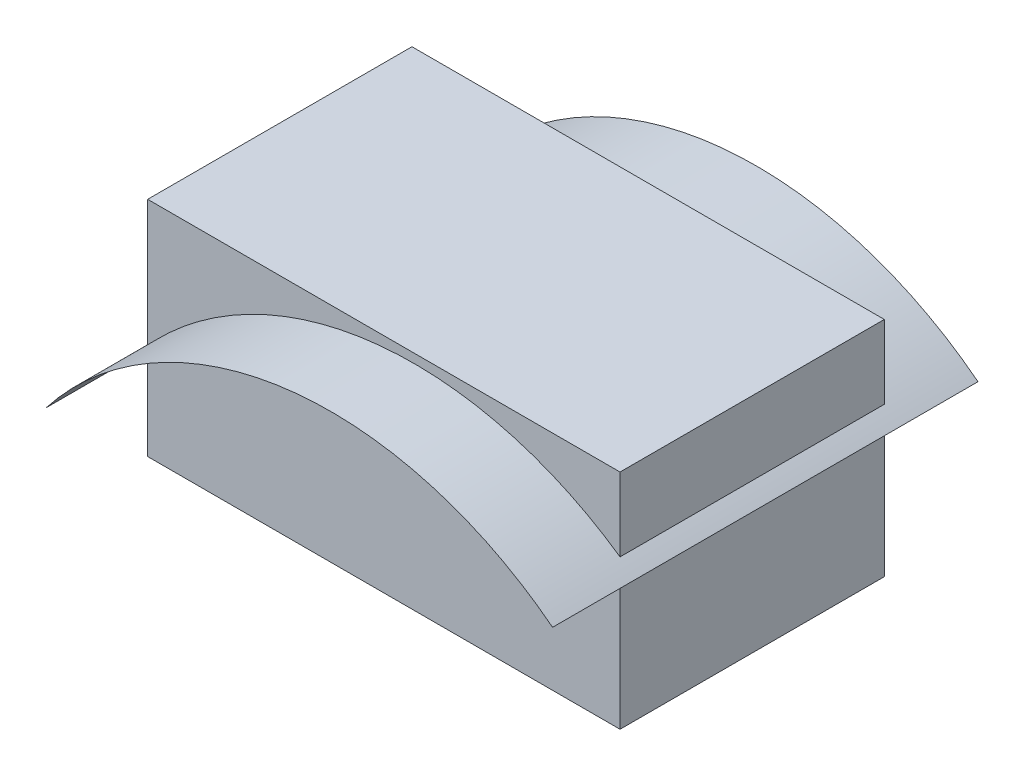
from build123d import *

# Parameters (mm, degrees)
SKETCH1_W      = 109.029585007
SKETCH1_H      = 51.429049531
EXTRUDE1_DEPTH = 30.5


with BuildPart() as part:
    # Sketch1 → Extrude1 (new, symmetric)
    with BuildSketch(Plane.XY):
        with Locations((54.514792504, 25.714524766)):
            Rectangle(SKETCH1_W, SKETCH1_H)
    extrude(amount=EXTRUDE1_DEPTH, both=True)


solid = part.part
